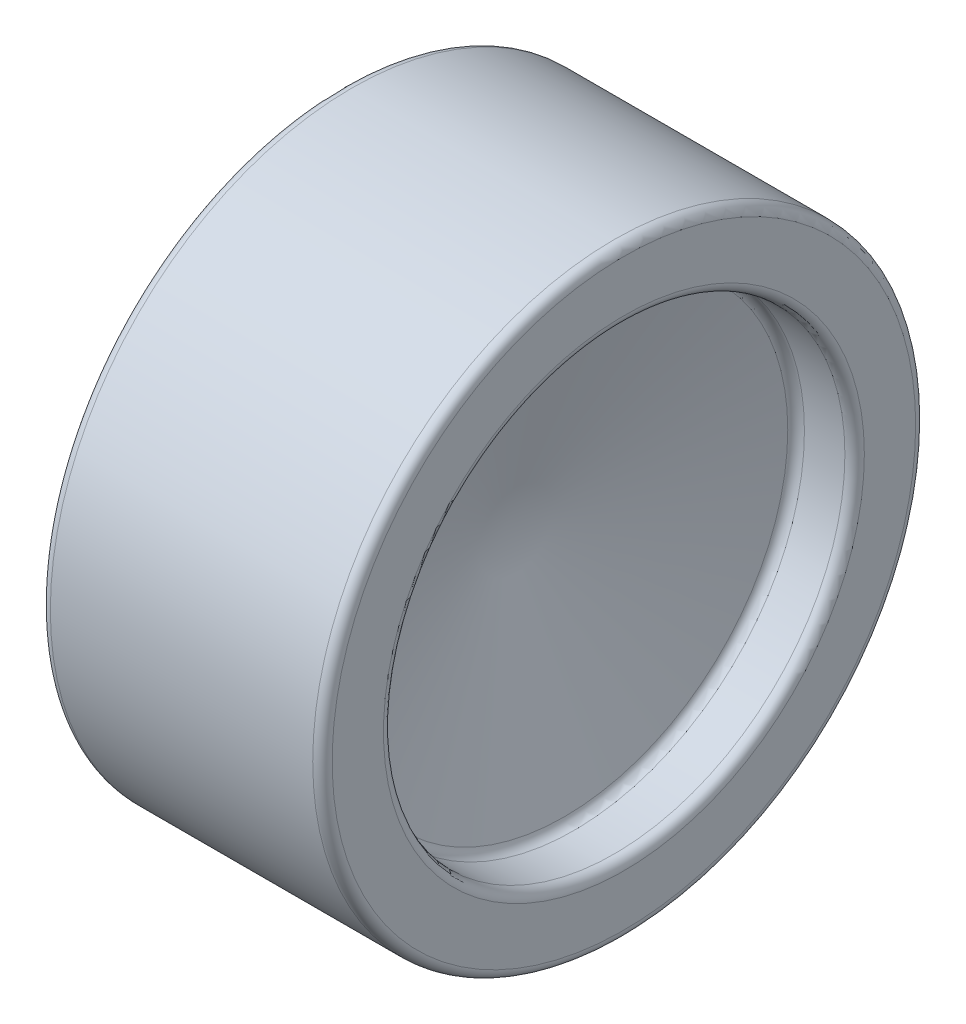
ISO-10303-21;
HEADER;
FILE_DESCRIPTION(('STEP AP214'),'2;1');
FILE_NAME('part.step','',(''),(''),'','','');
FILE_SCHEMA(('AUTOMOTIVE_DESIGN { 1 0 10303 214 1 1 1 1 }'));
ENDSEC;
DATA;
#1=APPLICATION_CONTEXT('core data for automotive mechanical design processes');
#2=APPLICATION_PROTOCOL_DEFINITION('international standard','automotive_design',2000,#1);
#3=PRODUCT_CONTEXT('',#1,'mechanical');
#4=PRODUCT('Part','Part','',(#3));
#5=PRODUCT_RELATED_PRODUCT_CATEGORY('part','',(#4));
#6=PRODUCT_DEFINITION_FORMATION('','',#4);
#7=PRODUCT_DEFINITION_CONTEXT('part definition',#1,'design');
#8=PRODUCT_DEFINITION('design','',#6,#7);
#9=PRODUCT_DEFINITION_SHAPE('','',#8);
#10=(LENGTH_UNIT() NAMED_UNIT(*) SI_UNIT(.MILLI.,.METRE.));
#11=(NAMED_UNIT(*) PLANE_ANGLE_UNIT() SI_UNIT($,.RADIAN.));
#12=(NAMED_UNIT(*) SI_UNIT($,.STERADIAN.) SOLID_ANGLE_UNIT());
#13=UNCERTAINTY_MEASURE_WITH_UNIT(LENGTH_MEASURE(1.E-05),#10,'distance_accuracy_value','');
#14=(GEOMETRIC_REPRESENTATION_CONTEXT(3) GLOBAL_UNCERTAINTY_ASSIGNED_CONTEXT((#13)) GLOBAL_UNIT_ASSIGNED_CONTEXT((#10,
#11,#12)) REPRESENTATION_CONTEXT('',''));
#15=CARTESIAN_POINT('',(0.,0.,0.));
#16=DIRECTION('',(0.,0.,1.));
#17=DIRECTION('',(1.,0.,0.));
#18=AXIS2_PLACEMENT_3D('',#15,#16,#17);
#19=CARTESIAN_POINT('',(289.814,0.,0.));
#20=DIRECTION('',(-1.,0.,0.));
#21=DIRECTION('',(0.,0.,1.));
#22=AXIS2_PLACEMENT_3D('',#19,#20,#21);
#23=CYLINDRICAL_SURFACE('',#22,310.007);
#24=CARTESIAN_POINT('',(10.,0.,0.));
#25=DIRECTION('',(1.,0.,0.));
#26=DIRECTION('',(0.,0.,-1.));
#27=AXIS2_PLACEMENT_3D('',#24,#25,#26);
#28=CIRCLE('',#27,310.007);
#29=CARTESIAN_POINT('',(10.,0.,-310.007));
#30=VERTEX_POINT('',#29);
#31=EDGE_CURVE('E11',#30,#30,#28,.T.);
#32=ORIENTED_EDGE('',*,*,#31,.T.);
#33=EDGE_LOOP('',(#32));
#34=FACE_BOUND('',#33,.T.);
#35=CARTESIAN_POINT('',(279.814,0.,0.));
#36=DIRECTION('',(1.,0.,0.));
#37=DIRECTION('',(0.,0.,-1.));
#38=AXIS2_PLACEMENT_3D('',#35,#36,#37);
#39=CIRCLE('',#38,310.007);
#40=CARTESIAN_POINT('',(279.814,0.,-310.007));
#41=VERTEX_POINT('',#40);
#42=EDGE_CURVE('E39',#41,#41,#39,.F.);
#43=ORIENTED_EDGE('',*,*,#42,.T.);
#44=EDGE_LOOP('',(#43));
#45=FACE_BOUND('',#44,.T.);
#46=ADVANCED_FACE('F32',(#34,#45),#23,.T.);
#47=CARTESIAN_POINT('',(289.814,0.,0.));
#48=DIRECTION('',(1.,0.,0.));
#49=DIRECTION('',(0.,0.,-1.));
#50=AXIS2_PLACEMENT_3D('',#47,#48,#49);
#51=PLANE('',#50);
#52=CARTESIAN_POINT('',(289.814,0.,0.));
#53=DIRECTION('',(1.,0.,0.));
#54=DIRECTION('',(0.,0.,-1.));
#55=AXIS2_PLACEMENT_3D('',#52,#53,#54);
#56=CIRCLE('',#55,247.249495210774);
#57=CARTESIAN_POINT('',(289.814,0.,-247.249495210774));
#58=VERTEX_POINT('',#57);
#59=EDGE_CURVE('E127',#58,#58,#56,.F.);
#60=ORIENTED_EDGE('',*,*,#59,.T.);
#61=EDGE_LOOP('',(#60));
#62=FACE_BOUND('',#61,.T.);
#63=CARTESIAN_POINT('',(289.814,0.,0.));
#64=DIRECTION('',(1.,0.,0.));
#65=DIRECTION('',(0.,0.,-1.));
#66=AXIS2_PLACEMENT_3D('',#63,#64,#65);
#67=CIRCLE('',#66,300.007);
#68=CARTESIAN_POINT('',(289.814,0.,-300.007));
#69=VERTEX_POINT('',#68);
#70=EDGE_CURVE('E124',#69,#69,#67,.T.);
#71=ORIENTED_EDGE('',*,*,#70,.T.);
#72=EDGE_LOOP('',(#71));
#73=FACE_BOUND('',#72,.T.);
#74=ADVANCED_FACE('F60',(#62,#73),#51,.T.);
#75=CARTESIAN_POINT('',(0.,0.,0.));
#76=DIRECTION('',(1.,0.,0.));
#77=DIRECTION('',(0.,0.,-1.));
#78=AXIS2_PLACEMENT_3D('',#75,#76,#77);
#79=PLANE('',#78);
#80=CARTESIAN_POINT('',(0.,0.,0.));
#81=DIRECTION('',(1.,0.,0.));
#82=DIRECTION('',(0.,0.,-1.));
#83=AXIS2_PLACEMENT_3D('',#80,#81,#82);
#84=CIRCLE('',#83,247.249495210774);
#85=CARTESIAN_POINT('',(0.,0.,-247.249495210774));
#86=VERTEX_POINT('',#85);
#87=EDGE_CURVE('E108',#86,#86,#84,.T.);
#88=ORIENTED_EDGE('',*,*,#87,.T.);
#89=EDGE_LOOP('',(#88));
#90=FACE_BOUND('',#89,.T.);
#91=CARTESIAN_POINT('',(0.,0.,0.));
#92=DIRECTION('',(1.,0.,0.));
#93=DIRECTION('',(0.,0.,-1.));
#94=AXIS2_PLACEMENT_3D('',#91,#92,#93);
#95=CIRCLE('',#94,300.007);
#96=CARTESIAN_POINT('',(0.,0.,-300.007));
#97=VERTEX_POINT('',#96);
#98=EDGE_CURVE('E105',#97,#97,#95,.F.);
#99=ORIENTED_EDGE('',*,*,#98,.T.);
#100=EDGE_LOOP('',(#99));
#101=FACE_BOUND('',#100,.T.);
#102=ADVANCED_FACE('F55',(#90,#101),#79,.F.);
#103=CARTESIAN_POINT('',(289.814,0.,0.));
#104=DIRECTION('',(1.,0.,0.));
#105=DIRECTION('',(0.,0.,-1.));
#106=AXIS2_PLACEMENT_3D('',#103,#104,#105);
#107=CYLINDRICAL_SURFACE('',#106,237.249495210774);
#108=CARTESIAN_POINT('',(279.814,0.,0.));
#109=DIRECTION('',(1.,0.,0.));
#110=DIRECTION('',(0.,0.,-1.));
#111=AXIS2_PLACEMENT_3D('',#108,#109,#110);
#112=CIRCLE('',#111,237.249495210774);
#113=CARTESIAN_POINT('',(279.814,0.,-237.249495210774));
#114=VERTEX_POINT('',#113);
#115=EDGE_CURVE('E121',#114,#114,#112,.T.);
#116=ORIENTED_EDGE('',*,*,#115,.T.);
#117=EDGE_LOOP('',(#116));
#118=FACE_BOUND('',#117,.T.);
#119=CARTESIAN_POINT('',(238.200794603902,0.,0.));
#120=DIRECTION('',(1.,0.,0.));
#121=DIRECTION('',(0.,0.,-1.));
#122=AXIS2_PLACEMENT_3D('',#119,#120,#121);
#123=CIRCLE('',#122,237.249495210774);
#124=CARTESIAN_POINT('',(238.200794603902,0.,-237.249495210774));
#125=VERTEX_POINT('',#124);
#126=EDGE_CURVE('E112',#125,#125,#123,.F.);
#127=ORIENTED_EDGE('',*,*,#126,.T.);
#128=EDGE_LOOP('',(#127));
#129=FACE_BOUND('',#128,.T.);
#130=ADVANCED_FACE('F45',(#118,#129),#107,.F.);
#131=CARTESIAN_POINT('',(230.478047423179,0.,0.));
#132=DIRECTION('',(1.,0.,0.));
#133=DIRECTION('',(0.,0.,-1.));
#134=AXIS2_PLACEMENT_3D('',#131,#132,#133);
#135=CONICAL_SURFACE('',#134,237.249495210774,1.3152103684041);
#136=CARTESIAN_POINT('',(228.525641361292,0.,0.));
#137=DIRECTION('',(1.,0.,0.));
#138=DIRECTION('',(0.,0.,-1.));
#139=AXIS2_PLACEMENT_3D('',#136,#137,#138);
#140=CIRCLE('',#139,229.77761896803);
#141=CARTESIAN_POINT('',(228.525641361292,0.,-229.77761896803));
#142=VERTEX_POINT('',#141);
#143=EDGE_CURVE('E130',#142,#142,#140,.T.);
#144=ORIENTED_EDGE('',*,*,#143,.T.);
#145=EDGE_LOOP('',(#144));
#146=FACE_BOUND('',#145,.T.);
#147=CARTESIAN_POINT('',(168.484601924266,0.,0.));
#148=VERTEX_POINT('',#147);
#149=VERTEX_LOOP('',#148);
#150=FACE_BOUND('',#149,.T.);
#151=ADVANCED_FACE('F42',(#146,#150),#135,.F.);
#152=CARTESIAN_POINT('',(289.814,0.,0.));
#153=DIRECTION('',(1.,0.,0.));
#154=DIRECTION('',(0.,0.,-1.));
#155=AXIS2_PLACEMENT_3D('',#152,#153,#154);
#156=CYLINDRICAL_SURFACE('',#155,106.184203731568);
#157=CARTESIAN_POINT('',(10.,0.,0.));
#158=DIRECTION('',(1.,0.,0.));
#159=DIRECTION('',(0.,0.,-1.));
#160=AXIS2_PLACEMENT_3D('',#157,#158,#159);
#161=CIRCLE('',#160,106.184203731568);
#162=CARTESIAN_POINT('',(10.,0.,-106.184203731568));
#163=VERTEX_POINT('',#162);
#164=EDGE_CURVE('E154',#163,#163,#161,.T.);
#165=ORIENTED_EDGE('',*,*,#164,.T.);
#166=EDGE_LOOP('',(#165));
#167=FACE_BOUND('',#166,.T.);
#168=CARTESIAN_POINT('',(85.4690104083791,0.,0.));
#169=DIRECTION('',(1.,0.,0.));
#170=DIRECTION('',(0.,0.,-1.));
#171=AXIS2_PLACEMENT_3D('',#168,#169,#170);
#172=CIRCLE('',#171,106.184203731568);
#173=CARTESIAN_POINT('',(85.4690104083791,0.,-106.184203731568));
#174=VERTEX_POINT('',#173);
#175=EDGE_CURVE('E157',#174,#174,#172,.F.);
#176=ORIENTED_EDGE('',*,*,#175,.T.);
#177=EDGE_LOOP('',(#176));
#178=FACE_BOUND('',#177,.T.);
#179=ADVANCED_FACE('F44',(#167,#178),#156,.T.);
#180=CARTESIAN_POINT('',(95.4690104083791,0.,-237.249495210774));
#181=DIRECTION('',(1.,0.,0.));
#182=DIRECTION('',(0.,0.,-1.));
#183=AXIS2_PLACEMENT_3D('',#180,#181,#182);
#184=PLANE('',#183);
#185=CARTESIAN_POINT('',(95.4690104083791,0.,0.));
#186=DIRECTION('',(1.,0.,0.));
#187=DIRECTION('',(0.,0.,-1.));
#188=AXIS2_PLACEMENT_3D('',#185,#186,#187);
#189=CIRCLE('',#188,116.184203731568);
#190=CARTESIAN_POINT('',(95.4690104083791,0.,-116.184203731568));
#191=VERTEX_POINT('',#190);
#192=EDGE_CURVE('E145',#191,#191,#189,.T.);
#193=ORIENTED_EDGE('',*,*,#192,.T.);
#194=EDGE_LOOP('',(#193));
#195=FACE_BOUND('',#194,.T.);
#196=CARTESIAN_POINT('',(95.4690104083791,0.,0.));
#197=DIRECTION('',(1.,0.,0.));
#198=DIRECTION('',(0.,0.,-1.));
#199=AXIS2_PLACEMENT_3D('',#196,#197,#198);
#200=CIRCLE('',#199,227.249495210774);
#201=CARTESIAN_POINT('',(95.4690104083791,0.,-227.249495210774));
#202=VERTEX_POINT('',#201);
#203=EDGE_CURVE('E148',#202,#202,#200,.F.);
#204=ORIENTED_EDGE('',*,*,#203,.T.);
#205=EDGE_LOOP('',(#204));
#206=FACE_BOUND('',#205,.T.);
#207=ADVANCED_FACE('F52',(#195,#206),#184,.F.);
#208=CARTESIAN_POINT('',(289.814,0.,0.));
#209=DIRECTION('',(1.,0.,0.));
#210=DIRECTION('',(0.,0.,-1.));
#211=AXIS2_PLACEMENT_3D('',#208,#209,#210);
#212=CYLINDRICAL_SURFACE('',#211,237.249495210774);
#213=CARTESIAN_POINT('',(85.4690104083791,0.,0.));
#214=DIRECTION('',(1.,0.,0.));
#215=DIRECTION('',(0.,0.,-1.));
#216=AXIS2_PLACEMENT_3D('',#213,#214,#215);
#217=CIRCLE('',#216,237.249495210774);
#218=CARTESIAN_POINT('',(85.4690104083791,0.,-237.249495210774));
#219=VERTEX_POINT('',#218);
#220=EDGE_CURVE('E109',#219,#219,#217,.T.);
#221=ORIENTED_EDGE('',*,*,#220,.T.);
#222=EDGE_LOOP('',(#221));
#223=FACE_BOUND('',#222,.T.);
#224=CARTESIAN_POINT('',(10.,0.,0.));
#225=DIRECTION('',(1.,0.,0.));
#226=DIRECTION('',(0.,0.,-1.));
#227=AXIS2_PLACEMENT_3D('',#224,#225,#226);
#228=CIRCLE('',#227,237.249495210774);
#229=CARTESIAN_POINT('',(10.,0.,-237.249495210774));
#230=VERTEX_POINT('',#229);
#231=EDGE_CURVE('E115',#230,#230,#228,.F.);
#232=ORIENTED_EDGE('',*,*,#231,.T.);
#233=EDGE_LOOP('',(#232));
#234=FACE_BOUND('',#233,.T.);
#235=ADVANCED_FACE('F166',(#223,#234),#212,.F.);
#236=CARTESIAN_POINT('',(0.,0.,0.));
#237=DIRECTION('',(1.,0.,0.));
#238=DIRECTION('',(0.,0.,-1.));
#239=AXIS2_PLACEMENT_3D('',#236,#237,#238);
#240=CIRCLE('',#239,96.1842037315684);
#241=CARTESIAN_POINT('',(0.,0.,-96.1842037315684));
#242=VERTEX_POINT('',#241);
#243=EDGE_CURVE('E151',#242,#242,#240,.F.);
#244=ORIENTED_EDGE('',*,*,#243,.T.);
#245=EDGE_LOOP('',(#244));
#246=FACE_BOUND('',#245,.T.);
#247=ADVANCED_FACE('F75',(#246),#79,.F.);
#248=CARTESIAN_POINT('',(10.,0.,0.));
#249=DIRECTION('',(1.,0.,0.));
#250=DIRECTION('',(0.,0.,-1.));
#251=AXIS2_PLACEMENT_3D('',#248,#249,#250);
#252=TOROIDAL_SURFACE('',#251,96.1842037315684,10.);
#253=ORIENTED_EDGE('',*,*,#243,.F.);
#254=EDGE_LOOP('',(#253));
#255=FACE_BOUND('',#254,.T.);
#256=ORIENTED_EDGE('',*,*,#164,.F.);
#257=EDGE_LOOP('',(#256));
#258=FACE_BOUND('',#257,.T.);
#259=ADVANCED_FACE('F71',(#255,#258),#252,.T.);
#260=CARTESIAN_POINT('',(85.4690104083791,0.,0.));
#261=DIRECTION('',(1.,0.,0.));
#262=DIRECTION('',(0.,0.,-1.));
#263=AXIS2_PLACEMENT_3D('',#260,#261,#262);
#264=TOROIDAL_SURFACE('',#263,116.184203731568,10.);
#265=ORIENTED_EDGE('',*,*,#175,.F.);
#266=EDGE_LOOP('',(#265));
#267=FACE_BOUND('',#266,.T.);
#268=ORIENTED_EDGE('',*,*,#192,.F.);
#269=EDGE_LOOP('',(#268));
#270=FACE_BOUND('',#269,.T.);
#271=ADVANCED_FACE('F74',(#267,#270),#264,.F.);
#272=CARTESIAN_POINT('',(85.4690104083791,0.,0.));
#273=DIRECTION('',(1.,0.,0.));
#274=DIRECTION('',(0.,0.,-1.));
#275=AXIS2_PLACEMENT_3D('',#272,#273,#274);
#276=TOROIDAL_SURFACE('',#275,227.249495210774,10.);
#277=ORIENTED_EDGE('',*,*,#203,.F.);
#278=EDGE_LOOP('',(#277));
#279=FACE_BOUND('',#278,.T.);
#280=ORIENTED_EDGE('',*,*,#220,.F.);
#281=EDGE_LOOP('',(#280));
#282=FACE_BOUND('',#281,.T.);
#283=ADVANCED_FACE('F79',(#279,#282),#276,.F.);
#284=CARTESIAN_POINT('',(10.,0.,0.));
#285=DIRECTION('',(1.,0.,0.));
#286=DIRECTION('',(0.,0.,-1.));
#287=AXIS2_PLACEMENT_3D('',#284,#285,#286);
#288=TOROIDAL_SURFACE('',#287,247.249495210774,10.);
#289=ORIENTED_EDGE('',*,*,#231,.F.);
#290=EDGE_LOOP('',(#289));
#291=FACE_BOUND('',#290,.T.);
#292=ORIENTED_EDGE('',*,*,#87,.F.);
#293=EDGE_LOOP('',(#292));
#294=FACE_BOUND('',#293,.T.);
#295=ADVANCED_FACE('F83',(#291,#294),#288,.T.);
#296=CARTESIAN_POINT('',(279.814,0.,0.));
#297=DIRECTION('',(1.,0.,0.));
#298=DIRECTION('',(0.,0.,-1.));
#299=AXIS2_PLACEMENT_3D('',#296,#297,#298);
#300=TOROIDAL_SURFACE('',#299,247.249495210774,10.);
#301=ORIENTED_EDGE('',*,*,#59,.F.);
#302=EDGE_LOOP('',(#301));
#303=FACE_BOUND('',#302,.T.);
#304=ORIENTED_EDGE('',*,*,#115,.F.);
#305=EDGE_LOOP('',(#304));
#306=FACE_BOUND('',#305,.T.);
#307=ADVANCED_FACE('F87',(#303,#306),#300,.T.);
#308=CARTESIAN_POINT('',(238.200794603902,0.,0.));
#309=DIRECTION('',(1.,0.,0.));
#310=DIRECTION('',(0.,0.,-1.));
#311=AXIS2_PLACEMENT_3D('',#308,#309,#310);
#312=TOROIDAL_SURFACE('',#311,227.249495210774,10.);
#313=ORIENTED_EDGE('',*,*,#126,.F.);
#314=EDGE_LOOP('',(#313));
#315=FACE_BOUND('',#314,.T.);
#316=ORIENTED_EDGE('',*,*,#143,.F.);
#317=EDGE_LOOP('',(#316));
#318=FACE_BOUND('',#317,.T.);
#319=ADVANCED_FACE('F91',(#315,#318),#312,.F.);
#320=CARTESIAN_POINT('',(10.,0.,0.));
#321=DIRECTION('',(1.,0.,0.));
#322=DIRECTION('',(0.,0.,-1.));
#323=AXIS2_PLACEMENT_3D('',#320,#321,#322);
#324=TOROIDAL_SURFACE('',#323,300.007,10.);
#325=ORIENTED_EDGE('',*,*,#98,.F.);
#326=EDGE_LOOP('',(#325));
#327=FACE_BOUND('',#326,.T.);
#328=ORIENTED_EDGE('',*,*,#31,.F.);
#329=EDGE_LOOP('',(#328));
#330=FACE_BOUND('',#329,.T.);
#331=ADVANCED_FACE('F94',(#327,#330),#324,.T.);
#332=CARTESIAN_POINT('',(279.814,0.,0.));
#333=DIRECTION('',(1.,0.,0.));
#334=DIRECTION('',(0.,0.,-1.));
#335=AXIS2_PLACEMENT_3D('',#332,#333,#334);
#336=TOROIDAL_SURFACE('',#335,300.007,10.);
#337=ORIENTED_EDGE('',*,*,#42,.F.);
#338=EDGE_LOOP('',(#337));
#339=FACE_BOUND('',#338,.T.);
#340=ORIENTED_EDGE('',*,*,#70,.F.);
#341=EDGE_LOOP('',(#340));
#342=FACE_BOUND('',#341,.T.);
#343=ADVANCED_FACE('F34',(#339,#342),#336,.T.);
#344=CLOSED_SHELL('',(#46,#74,#102,#130,#151,#179,#207,#235,#247,#259,#271,#283,#295,#307,#319,
#331,#343));
#345=MANIFOLD_SOLID_BREP('B2',#344);
#346=ADVANCED_BREP_SHAPE_REPRESENTATION('',(#18,#345),#14);
#347=SHAPE_DEFINITION_REPRESENTATION(#9,#346);
ENDSEC;
END-ISO-10303-21;
